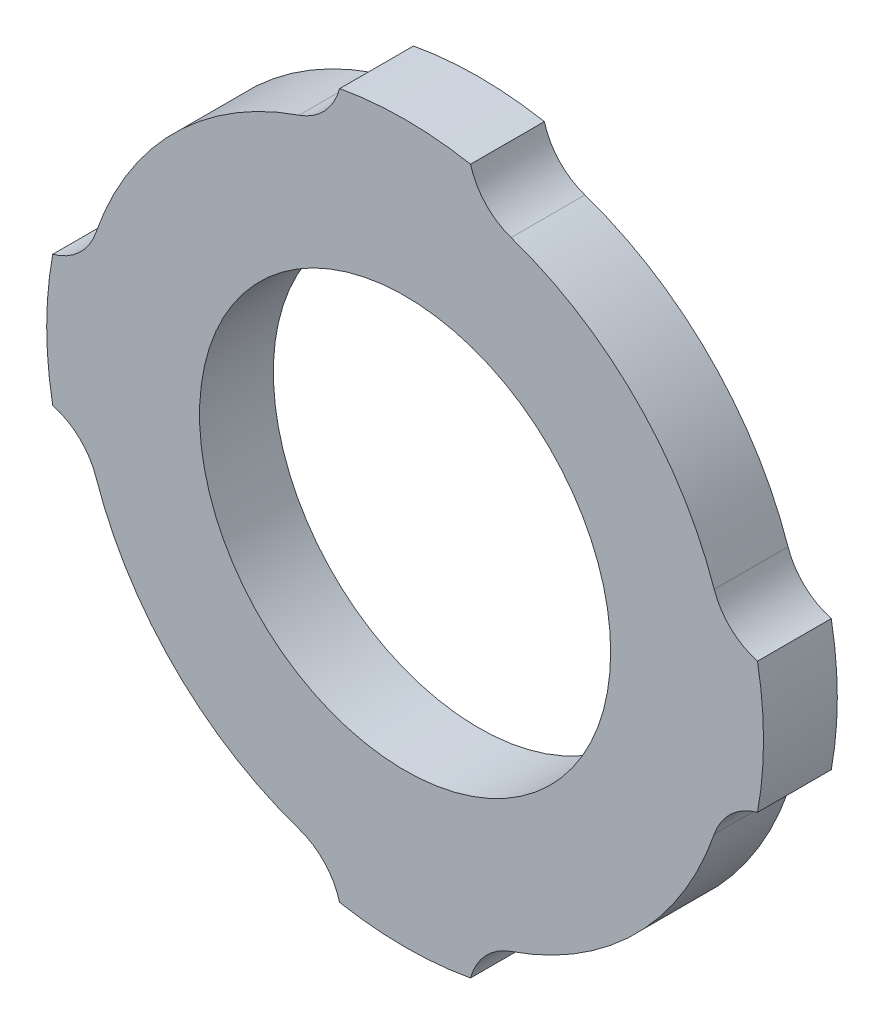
ISO-10303-21;
HEADER;
FILE_DESCRIPTION(('STEP AP214'),'2;1');
FILE_NAME('part.step','',(''),(''),'','','');
FILE_SCHEMA(('AUTOMOTIVE_DESIGN { 1 0 10303 214 1 1 1 1 }'));
ENDSEC;
DATA;
#1=APPLICATION_CONTEXT('core data for automotive mechanical design processes');
#2=APPLICATION_PROTOCOL_DEFINITION('international standard','automotive_design',2000,#1);
#3=PRODUCT_CONTEXT('',#1,'mechanical');
#4=PRODUCT('Part','Part','',(#3));
#5=PRODUCT_RELATED_PRODUCT_CATEGORY('part','',(#4));
#6=PRODUCT_DEFINITION_FORMATION('','',#4);
#7=PRODUCT_DEFINITION_CONTEXT('part definition',#1,'design');
#8=PRODUCT_DEFINITION('design','',#6,#7);
#9=PRODUCT_DEFINITION_SHAPE('','',#8);
#10=(LENGTH_UNIT() NAMED_UNIT(*) SI_UNIT(.MILLI.,.METRE.));
#11=(NAMED_UNIT(*) PLANE_ANGLE_UNIT() SI_UNIT($,.RADIAN.));
#12=(NAMED_UNIT(*) SI_UNIT($,.STERADIAN.) SOLID_ANGLE_UNIT());
#13=UNCERTAINTY_MEASURE_WITH_UNIT(LENGTH_MEASURE(1.E-05),#10,'distance_accuracy_value','');
#14=(GEOMETRIC_REPRESENTATION_CONTEXT(3) GLOBAL_UNCERTAINTY_ASSIGNED_CONTEXT((#13)) GLOBAL_UNIT_ASSIGNED_CONTEXT((#10,
#11,#12)) REPRESENTATION_CONTEXT('',''));
#15=CARTESIAN_POINT('',(0.,0.,0.));
#16=DIRECTION('',(0.,0.,1.));
#17=DIRECTION('',(1.,0.,0.));
#18=AXIS2_PLACEMENT_3D('',#15,#16,#17);
#19=CARTESIAN_POINT('',(0.,0.,6.99999999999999));
#20=DIRECTION('',(0.,0.,-1.));
#21=DIRECTION('',(-1.,0.,0.));
#22=AXIS2_PLACEMENT_3D('',#19,#20,#21);
#23=PLANE('',#22);
#24=CARTESIAN_POINT('',(0.,0.,6.99999999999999));
#25=DIRECTION('',(0.,0.,1.));
#26=DIRECTION('',(1.,0.,0.));
#27=AXIS2_PLACEMENT_3D('',#24,#25,#26);
#28=CIRCLE('',#27,19.5);
#29=CARTESIAN_POINT('',(19.5,0.,6.99999999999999));
#30=VERTEX_POINT('',#29);
#31=EDGE_CURVE('E143',#30,#30,#28,.F.);
#32=ORIENTED_EDGE('',*,*,#31,.T.);
#33=EDGE_LOOP('',(#32));
#34=FACE_BOUND('',#33,.T.);
#35=CARTESIAN_POINT('',(-35.,-12.,6.99999999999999));
#36=DIRECTION('',(0.,0.,-1.));
#37=DIRECTION('',(-1.,0.,0.));
#38=AXIS2_PLACEMENT_3D('',#35,#36,#37);
#39=CIRCLE('',#38,6.);
#40=CARTESIAN_POINT('',(-33.4281539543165,-6.20955096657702,6.99999999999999));
#41=VERTEX_POINT('',#40);
#42=CARTESIAN_POINT('',(-29.3243243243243,-10.054054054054,6.99999999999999));
#43=VERTEX_POINT('',#42);
#44=EDGE_CURVE('E131',#41,#43,#39,.T.);
#45=ORIENTED_EDGE('',*,*,#44,.T.);
#46=CARTESIAN_POINT('',(0.,0.,6.99999999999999));
#47=DIRECTION('',(0.,0.,1.));
#48=DIRECTION('',(1.,0.,0.));
#49=AXIS2_PLACEMENT_3D('',#46,#47,#48);
#50=CIRCLE('',#49,31.);
#51=CARTESIAN_POINT('',(-10.0540540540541,-29.3243243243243,6.99999999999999));
#52=VERTEX_POINT('',#51);
#53=EDGE_CURVE('E146',#52,#43,#50,.F.);
#54=ORIENTED_EDGE('',*,*,#53,.F.);
#55=CARTESIAN_POINT('',(-12.,-35.,6.99999999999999));
#56=DIRECTION('',(0.,0.,1.));
#57=DIRECTION('',(1.,0.,0.));
#58=AXIS2_PLACEMENT_3D('',#55,#56,#57);
#59=CIRCLE('',#58,6.);
#60=CARTESIAN_POINT('',(-6.20955096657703,-33.4281539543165,6.99999999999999));
#61=VERTEX_POINT('',#60);
#62=EDGE_CURVE('E154',#52,#61,#59,.F.);
#63=ORIENTED_EDGE('',*,*,#62,.T.);
#64=CARTESIAN_POINT('',(0.,0.,6.99999999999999));
#65=DIRECTION('',(0.,0.,-1.));
#66=DIRECTION('',(-1.,0.,0.));
#67=AXIS2_PLACEMENT_3D('',#64,#65,#66);
#68=CIRCLE('',#67,34.);
#69=CARTESIAN_POINT('',(6.20955096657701,-33.4281539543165,6.99999999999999));
#70=VERTEX_POINT('',#69);
#71=EDGE_CURVE('E157',#70,#61,#68,.T.);
#72=ORIENTED_EDGE('',*,*,#71,.F.);
#73=CARTESIAN_POINT('',(12.,-35.,6.99999999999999));
#74=DIRECTION('',(0.,0.,-1.));
#75=DIRECTION('',(-1.,0.,0.));
#76=AXIS2_PLACEMENT_3D('',#73,#74,#75);
#77=CIRCLE('',#76,6.);
#78=CARTESIAN_POINT('',(10.054054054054,-29.3243243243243,6.99999999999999));
#79=VERTEX_POINT('',#78);
#80=EDGE_CURVE('E161',#70,#79,#77,.T.);
#81=ORIENTED_EDGE('',*,*,#80,.T.);
#82=CARTESIAN_POINT('',(0.,0.,6.99999999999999));
#83=DIRECTION('',(0.,0.,1.));
#84=DIRECTION('',(1.,0.,0.));
#85=AXIS2_PLACEMENT_3D('',#82,#83,#84);
#86=CIRCLE('',#85,31.);
#87=CARTESIAN_POINT('',(29.3243243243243,-10.0540540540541,6.99999999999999));
#88=VERTEX_POINT('',#87);
#89=EDGE_CURVE('E164',#88,#79,#86,.F.);
#90=ORIENTED_EDGE('',*,*,#89,.F.);
#91=CARTESIAN_POINT('',(35.,-12.,6.99999999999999));
#92=DIRECTION('',(0.,0.,1.));
#93=DIRECTION('',(1.,0.,0.));
#94=AXIS2_PLACEMENT_3D('',#91,#92,#93);
#95=CIRCLE('',#94,6.);
#96=CARTESIAN_POINT('',(33.4281539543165,-6.20955096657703,6.99999999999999));
#97=VERTEX_POINT('',#96);
#98=EDGE_CURVE('E168',#88,#97,#95,.F.);
#99=ORIENTED_EDGE('',*,*,#98,.T.);
#100=CARTESIAN_POINT('',(0.,0.,6.99999999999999));
#101=DIRECTION('',(0.,0.,-1.));
#102=DIRECTION('',(-1.,0.,0.));
#103=AXIS2_PLACEMENT_3D('',#100,#101,#102);
#104=CIRCLE('',#103,34.);
#105=CARTESIAN_POINT('',(33.4281539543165,6.20955096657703,6.99999999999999));
#106=VERTEX_POINT('',#105);
#107=EDGE_CURVE('E171',#106,#97,#104,.T.);
#108=ORIENTED_EDGE('',*,*,#107,.F.);
#109=CARTESIAN_POINT('',(35.,12.,6.99999999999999));
#110=DIRECTION('',(0.,0.,-1.));
#111=DIRECTION('',(-1.,0.,0.));
#112=AXIS2_PLACEMENT_3D('',#109,#110,#111);
#113=CIRCLE('',#112,6.);
#114=CARTESIAN_POINT('',(29.3243243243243,10.054054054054,6.99999999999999));
#115=VERTEX_POINT('',#114);
#116=EDGE_CURVE('E175',#106,#115,#113,.T.);
#117=ORIENTED_EDGE('',*,*,#116,.T.);
#118=CARTESIAN_POINT('',(0.,0.,6.99999999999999));
#119=DIRECTION('',(0.,0.,1.));
#120=DIRECTION('',(1.,0.,0.));
#121=AXIS2_PLACEMENT_3D('',#118,#119,#120);
#122=CIRCLE('',#121,31.);
#123=CARTESIAN_POINT('',(10.0540540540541,29.3243243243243,6.99999999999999));
#124=VERTEX_POINT('',#123);
#125=EDGE_CURVE('E178',#124,#115,#122,.F.);
#126=ORIENTED_EDGE('',*,*,#125,.F.);
#127=CARTESIAN_POINT('',(12.,35.,6.99999999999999));
#128=DIRECTION('',(0.,0.,1.));
#129=DIRECTION('',(1.,0.,0.));
#130=AXIS2_PLACEMENT_3D('',#127,#128,#129);
#131=CIRCLE('',#130,6.);
#132=CARTESIAN_POINT('',(6.20955096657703,33.4281539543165,6.99999999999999));
#133=VERTEX_POINT('',#132);
#134=EDGE_CURVE('E182',#124,#133,#131,.F.);
#135=ORIENTED_EDGE('',*,*,#134,.T.);
#136=CARTESIAN_POINT('',(0.,0.,6.99999999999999));
#137=DIRECTION('',(0.,0.,-1.));
#138=DIRECTION('',(-1.,0.,0.));
#139=AXIS2_PLACEMENT_3D('',#136,#137,#138);
#140=CIRCLE('',#139,34.);
#141=CARTESIAN_POINT('',(-6.20955096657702,33.4281539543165,6.99999999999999));
#142=VERTEX_POINT('',#141);
#143=EDGE_CURVE('E185',#142,#133,#140,.T.);
#144=ORIENTED_EDGE('',*,*,#143,.F.);
#145=CARTESIAN_POINT('',(-12.,35.,6.99999999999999));
#146=DIRECTION('',(0.,0.,-1.));
#147=DIRECTION('',(-1.,0.,0.));
#148=AXIS2_PLACEMENT_3D('',#145,#146,#147);
#149=CIRCLE('',#148,6.);
#150=CARTESIAN_POINT('',(-10.054054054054,29.3243243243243,6.99999999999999));
#151=VERTEX_POINT('',#150);
#152=EDGE_CURVE('E189',#142,#151,#149,.T.);
#153=ORIENTED_EDGE('',*,*,#152,.T.);
#154=CARTESIAN_POINT('',(0.,0.,6.99999999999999));
#155=DIRECTION('',(0.,0.,1.));
#156=DIRECTION('',(1.,0.,0.));
#157=AXIS2_PLACEMENT_3D('',#154,#155,#156);
#158=CIRCLE('',#157,31.);
#159=CARTESIAN_POINT('',(-29.3243243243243,10.0540540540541,6.99999999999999));
#160=VERTEX_POINT('',#159);
#161=EDGE_CURVE('E192',#160,#151,#158,.F.);
#162=ORIENTED_EDGE('',*,*,#161,.F.);
#163=CARTESIAN_POINT('',(-35.,12.,6.99999999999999));
#164=DIRECTION('',(0.,0.,1.));
#165=DIRECTION('',(1.,0.,0.));
#166=AXIS2_PLACEMENT_3D('',#163,#164,#165);
#167=CIRCLE('',#166,6.);
#168=CARTESIAN_POINT('',(-33.4281539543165,6.20955096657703,6.99999999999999));
#169=VERTEX_POINT('',#168);
#170=EDGE_CURVE('E133',#160,#169,#167,.F.);
#171=ORIENTED_EDGE('',*,*,#170,.T.);
#172=CARTESIAN_POINT('',(0.,0.,6.99999999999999));
#173=DIRECTION('',(0.,0.,-1.));
#174=DIRECTION('',(-1.,0.,0.));
#175=AXIS2_PLACEMENT_3D('',#172,#173,#174);
#176=CIRCLE('',#175,34.);
#177=EDGE_CURVE('E20',#41,#169,#176,.T.);
#178=ORIENTED_EDGE('',*,*,#177,.F.);
#179=EDGE_LOOP('',(#45,#54,#63,#72,#81,#90,#99,#108,#117,#126,#135,#144,#153,#162,#171,#178));
#180=FACE_BOUND('',#179,.T.);
#181=ADVANCED_FACE('F17',(#34,#180),#23,.F.);
#182=CARTESIAN_POINT('',(0.,0.,6.99999999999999));
#183=DIRECTION('',(0.,0.,-1.));
#184=DIRECTION('',(-1.,0.,0.));
#185=AXIS2_PLACEMENT_3D('',#182,#183,#184);
#186=CYLINDRICAL_SURFACE('',#185,34.);
#187=ORIENTED_EDGE('',*,*,#177,.T.);
#188=DIRECTION('',(0.,0.,1.));
#189=VECTOR('',#188,1.);
#190=CARTESIAN_POINT('',(-33.4281539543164,6.20955096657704,0.));
#191=LINE('',#190,#189);
#192=CARTESIAN_POINT('',(-33.4281539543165,6.20955096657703,0.));
#193=VERTEX_POINT('',#192);
#194=EDGE_CURVE('E195',#169,#193,#191,.F.);
#195=ORIENTED_EDGE('',*,*,#194,.T.);
#196=CARTESIAN_POINT('',(0.,0.,0.));
#197=DIRECTION('',(0.,0.,-1.));
#198=DIRECTION('',(-1.,0.,0.));
#199=AXIS2_PLACEMENT_3D('',#196,#197,#198);
#200=CIRCLE('',#199,34.);
#201=CARTESIAN_POINT('',(-33.4281539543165,-6.20955096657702,0.));
#202=VERTEX_POINT('',#201);
#203=EDGE_CURVE('E140',#202,#193,#200,.T.);
#204=ORIENTED_EDGE('',*,*,#203,.F.);
#205=DIRECTION('',(0.,0.,-1.));
#206=VECTOR('',#205,1.);
#207=CARTESIAN_POINT('',(-33.4281539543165,-6.20955096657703,0.));
#208=LINE('',#207,#206);
#209=EDGE_CURVE('E137',#202,#41,#208,.F.);
#210=ORIENTED_EDGE('',*,*,#209,.T.);
#211=EDGE_LOOP('',(#187,#195,#204,#210));
#212=FACE_BOUND('',#211,.T.);
#213=ADVANCED_FACE('F138',(#212),#186,.T.);
#214=CARTESIAN_POINT('',(-35.,12.,0.));
#215=DIRECTION('',(0.,0.,1.));
#216=DIRECTION('',(1.,0.,0.));
#217=AXIS2_PLACEMENT_3D('',#214,#215,#216);
#218=CYLINDRICAL_SURFACE('',#217,6.);
#219=ORIENTED_EDGE('',*,*,#170,.F.);
#220=DIRECTION('',(0.,0.,1.));
#221=VECTOR('',#220,1.);
#222=CARTESIAN_POINT('',(-29.3243243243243,10.0540540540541,0.));
#223=LINE('',#222,#221);
#224=CARTESIAN_POINT('',(-29.3243243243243,10.0540540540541,0.));
#225=VERTEX_POINT('',#224);
#226=EDGE_CURVE('E194',#225,#160,#223,.T.);
#227=ORIENTED_EDGE('',*,*,#226,.F.);
#228=CARTESIAN_POINT('',(-35.,12.,0.));
#229=DIRECTION('',(0.,0.,1.));
#230=DIRECTION('',(1.,0.,0.));
#231=AXIS2_PLACEMENT_3D('',#228,#229,#230);
#232=CIRCLE('',#231,6.);
#233=EDGE_CURVE('E242',#193,#225,#232,.T.);
#234=ORIENTED_EDGE('',*,*,#233,.F.);
#235=ORIENTED_EDGE('',*,*,#194,.F.);
#236=EDGE_LOOP('',(#219,#227,#234,#235));
#237=FACE_BOUND('',#236,.T.);
#238=ADVANCED_FACE('F314',(#237),#218,.F.);
#239=CARTESIAN_POINT('',(0.,0.,0.));
#240=DIRECTION('',(0.,0.,1.));
#241=DIRECTION('',(1.,0.,0.));
#242=AXIS2_PLACEMENT_3D('',#239,#240,#241);
#243=CYLINDRICAL_SURFACE('',#242,31.);
#244=DIRECTION('',(0.,0.,-1.));
#245=VECTOR('',#244,1.);
#246=CARTESIAN_POINT('',(-10.054054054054,29.3243243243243,0.));
#247=LINE('',#246,#245);
#248=CARTESIAN_POINT('',(-10.054054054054,29.3243243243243,0.));
#249=VERTEX_POINT('',#248);
#250=EDGE_CURVE('E191',#151,#249,#247,.T.);
#251=ORIENTED_EDGE('',*,*,#250,.T.);
#252=CARTESIAN_POINT('',(0.,0.,0.));
#253=DIRECTION('',(0.,0.,1.));
#254=DIRECTION('',(1.,0.,0.));
#255=AXIS2_PLACEMENT_3D('',#252,#253,#254);
#256=CIRCLE('',#255,31.);
#257=EDGE_CURVE('E239',#225,#249,#256,.F.);
#258=ORIENTED_EDGE('',*,*,#257,.F.);
#259=ORIENTED_EDGE('',*,*,#226,.T.);
#260=ORIENTED_EDGE('',*,*,#161,.T.);
#261=EDGE_LOOP('',(#251,#258,#259,#260));
#262=FACE_BOUND('',#261,.T.);
#263=ADVANCED_FACE('F310',(#262),#243,.T.);
#264=CARTESIAN_POINT('',(-12.,35.,0.));
#265=DIRECTION('',(0.,0.,-1.));
#266=DIRECTION('',(-1.,0.,0.));
#267=AXIS2_PLACEMENT_3D('',#264,#265,#266);
#268=CYLINDRICAL_SURFACE('',#267,6.);
#269=CARTESIAN_POINT('',(-12.,35.,0.));
#270=DIRECTION('',(0.,0.,-1.));
#271=DIRECTION('',(-1.,0.,0.));
#272=AXIS2_PLACEMENT_3D('',#269,#270,#271);
#273=CIRCLE('',#272,6.);
#274=CARTESIAN_POINT('',(-6.20955096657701,33.4281539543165,0.));
#275=VERTEX_POINT('',#274);
#276=EDGE_CURVE('E236',#249,#275,#273,.F.);
#277=ORIENTED_EDGE('',*,*,#276,.F.);
#278=ORIENTED_EDGE('',*,*,#250,.F.);
#279=ORIENTED_EDGE('',*,*,#152,.F.);
#280=DIRECTION('',(0.,0.,-1.));
#281=VECTOR('',#280,1.);
#282=CARTESIAN_POINT('',(-6.20955096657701,33.4281539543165,6.99999999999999));
#283=LINE('',#282,#281);
#284=EDGE_CURVE('E188',#275,#142,#283,.F.);
#285=ORIENTED_EDGE('',*,*,#284,.F.);
#286=EDGE_LOOP('',(#277,#278,#279,#285));
#287=FACE_BOUND('',#286,.T.);
#288=ADVANCED_FACE('F306',(#287),#268,.F.);
#289=CARTESIAN_POINT('',(0.,0.,6.99999999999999));
#290=DIRECTION('',(0.,0.,-1.));
#291=DIRECTION('',(-1.,0.,0.));
#292=AXIS2_PLACEMENT_3D('',#289,#290,#291);
#293=CYLINDRICAL_SURFACE('',#292,34.);
#294=ORIENTED_EDGE('',*,*,#143,.T.);
#295=DIRECTION('',(0.,0.,1.));
#296=VECTOR('',#295,1.);
#297=CARTESIAN_POINT('',(6.20955096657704,33.4281539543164,0.));
#298=LINE('',#297,#296);
#299=CARTESIAN_POINT('',(6.20955096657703,33.4281539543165,0.));
#300=VERTEX_POINT('',#299);
#301=EDGE_CURVE('E184',#133,#300,#298,.F.);
#302=ORIENTED_EDGE('',*,*,#301,.T.);
#303=CARTESIAN_POINT('',(0.,0.,0.));
#304=DIRECTION('',(0.,0.,-1.));
#305=DIRECTION('',(-1.,0.,0.));
#306=AXIS2_PLACEMENT_3D('',#303,#304,#305);
#307=CIRCLE('',#306,34.);
#308=EDGE_CURVE('E233',#275,#300,#307,.T.);
#309=ORIENTED_EDGE('',*,*,#308,.F.);
#310=ORIENTED_EDGE('',*,*,#284,.T.);
#311=EDGE_LOOP('',(#294,#302,#309,#310));
#312=FACE_BOUND('',#311,.T.);
#313=ADVANCED_FACE('F302',(#312),#293,.T.);
#314=CARTESIAN_POINT('',(12.,35.,0.));
#315=DIRECTION('',(0.,0.,1.));
#316=DIRECTION('',(1.,0.,0.));
#317=AXIS2_PLACEMENT_3D('',#314,#315,#316);
#318=CYLINDRICAL_SURFACE('',#317,6.);
#319=ORIENTED_EDGE('',*,*,#134,.F.);
#320=DIRECTION('',(0.,0.,1.));
#321=VECTOR('',#320,1.);
#322=CARTESIAN_POINT('',(10.0540540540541,29.3243243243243,0.));
#323=LINE('',#322,#321);
#324=CARTESIAN_POINT('',(10.0540540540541,29.3243243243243,0.));
#325=VERTEX_POINT('',#324);
#326=EDGE_CURVE('E181',#325,#124,#323,.T.);
#327=ORIENTED_EDGE('',*,*,#326,.F.);
#328=CARTESIAN_POINT('',(12.,35.,0.));
#329=DIRECTION('',(0.,0.,1.));
#330=DIRECTION('',(1.,0.,0.));
#331=AXIS2_PLACEMENT_3D('',#328,#329,#330);
#332=CIRCLE('',#331,6.);
#333=EDGE_CURVE('E230',#300,#325,#332,.T.);
#334=ORIENTED_EDGE('',*,*,#333,.F.);
#335=ORIENTED_EDGE('',*,*,#301,.F.);
#336=EDGE_LOOP('',(#319,#327,#334,#335));
#337=FACE_BOUND('',#336,.T.);
#338=ADVANCED_FACE('F298',(#337),#318,.F.);
#339=CARTESIAN_POINT('',(0.,0.,0.));
#340=DIRECTION('',(0.,0.,1.));
#341=DIRECTION('',(1.,0.,0.));
#342=AXIS2_PLACEMENT_3D('',#339,#340,#341);
#343=CYLINDRICAL_SURFACE('',#342,31.);
#344=ORIENTED_EDGE('',*,*,#326,.T.);
#345=ORIENTED_EDGE('',*,*,#125,.T.);
#346=DIRECTION('',(0.,0.,-1.));
#347=VECTOR('',#346,1.);
#348=CARTESIAN_POINT('',(29.3243243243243,10.054054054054,0.));
#349=LINE('',#348,#347);
#350=CARTESIAN_POINT('',(29.3243243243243,10.054054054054,0.));
#351=VERTEX_POINT('',#350);
#352=EDGE_CURVE('E177',#115,#351,#349,.T.);
#353=ORIENTED_EDGE('',*,*,#352,.T.);
#354=CARTESIAN_POINT('',(0.,0.,0.));
#355=DIRECTION('',(0.,0.,1.));
#356=DIRECTION('',(1.,0.,0.));
#357=AXIS2_PLACEMENT_3D('',#354,#355,#356);
#358=CIRCLE('',#357,31.);
#359=EDGE_CURVE('E227',#325,#351,#358,.F.);
#360=ORIENTED_EDGE('',*,*,#359,.F.);
#361=EDGE_LOOP('',(#344,#345,#353,#360));
#362=FACE_BOUND('',#361,.T.);
#363=ADVANCED_FACE('F294',(#362),#343,.T.);
#364=CARTESIAN_POINT('',(35.,12.,0.));
#365=DIRECTION('',(0.,0.,-1.));
#366=DIRECTION('',(-1.,0.,0.));
#367=AXIS2_PLACEMENT_3D('',#364,#365,#366);
#368=CYLINDRICAL_SURFACE('',#367,6.);
#369=CARTESIAN_POINT('',(35.,12.,0.));
#370=DIRECTION('',(0.,0.,-1.));
#371=DIRECTION('',(-1.,0.,0.));
#372=AXIS2_PLACEMENT_3D('',#369,#370,#371);
#373=CIRCLE('',#372,6.);
#374=CARTESIAN_POINT('',(33.4281539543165,6.20955096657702,0.));
#375=VERTEX_POINT('',#374);
#376=EDGE_CURVE('E224',#351,#375,#373,.F.);
#377=ORIENTED_EDGE('',*,*,#376,.F.);
#378=ORIENTED_EDGE('',*,*,#352,.F.);
#379=ORIENTED_EDGE('',*,*,#116,.F.);
#380=DIRECTION('',(0.,0.,-1.));
#381=VECTOR('',#380,1.);
#382=CARTESIAN_POINT('',(33.4281539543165,6.20955096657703,6.99999999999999));
#383=LINE('',#382,#381);
#384=EDGE_CURVE('E174',#375,#106,#383,.F.);
#385=ORIENTED_EDGE('',*,*,#384,.F.);
#386=EDGE_LOOP('',(#377,#378,#379,#385));
#387=FACE_BOUND('',#386,.T.);
#388=ADVANCED_FACE('F290',(#387),#368,.F.);
#389=CARTESIAN_POINT('',(0.,0.,6.99999999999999));
#390=DIRECTION('',(0.,0.,-1.));
#391=DIRECTION('',(-1.,0.,0.));
#392=AXIS2_PLACEMENT_3D('',#389,#390,#391);
#393=CYLINDRICAL_SURFACE('',#392,34.);
#394=ORIENTED_EDGE('',*,*,#107,.T.);
#395=DIRECTION('',(0.,0.,1.));
#396=VECTOR('',#395,1.);
#397=CARTESIAN_POINT('',(33.4281539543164,-6.20955096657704,0.));
#398=LINE('',#397,#396);
#399=CARTESIAN_POINT('',(33.4281539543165,-6.20955096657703,0.));
#400=VERTEX_POINT('',#399);
#401=EDGE_CURVE('E170',#97,#400,#398,.F.);
#402=ORIENTED_EDGE('',*,*,#401,.T.);
#403=CARTESIAN_POINT('',(0.,0.,0.));
#404=DIRECTION('',(0.,0.,-1.));
#405=DIRECTION('',(-1.,0.,0.));
#406=AXIS2_PLACEMENT_3D('',#403,#404,#405);
#407=CIRCLE('',#406,34.);
#408=EDGE_CURVE('E221',#375,#400,#407,.T.);
#409=ORIENTED_EDGE('',*,*,#408,.F.);
#410=ORIENTED_EDGE('',*,*,#384,.T.);
#411=EDGE_LOOP('',(#394,#402,#409,#410));
#412=FACE_BOUND('',#411,.T.);
#413=ADVANCED_FACE('F286',(#412),#393,.T.);
#414=CARTESIAN_POINT('',(35.,-12.,0.));
#415=DIRECTION('',(0.,0.,1.));
#416=DIRECTION('',(1.,0.,0.));
#417=AXIS2_PLACEMENT_3D('',#414,#415,#416);
#418=CYLINDRICAL_SURFACE('',#417,6.);
#419=ORIENTED_EDGE('',*,*,#98,.F.);
#420=DIRECTION('',(0.,0.,1.));
#421=VECTOR('',#420,1.);
#422=CARTESIAN_POINT('',(29.3243243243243,-10.0540540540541,0.));
#423=LINE('',#422,#421);
#424=CARTESIAN_POINT('',(29.3243243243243,-10.0540540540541,0.));
#425=VERTEX_POINT('',#424);
#426=EDGE_CURVE('E167',#425,#88,#423,.T.);
#427=ORIENTED_EDGE('',*,*,#426,.F.);
#428=CARTESIAN_POINT('',(35.,-12.,0.));
#429=DIRECTION('',(0.,0.,1.));
#430=DIRECTION('',(1.,0.,0.));
#431=AXIS2_PLACEMENT_3D('',#428,#429,#430);
#432=CIRCLE('',#431,6.);
#433=EDGE_CURVE('E218',#400,#425,#432,.T.);
#434=ORIENTED_EDGE('',*,*,#433,.F.);
#435=ORIENTED_EDGE('',*,*,#401,.F.);
#436=EDGE_LOOP('',(#419,#427,#434,#435));
#437=FACE_BOUND('',#436,.T.);
#438=ADVANCED_FACE('F282',(#437),#418,.F.);
#439=CARTESIAN_POINT('',(0.,0.,0.));
#440=DIRECTION('',(0.,0.,1.));
#441=DIRECTION('',(1.,0.,0.));
#442=AXIS2_PLACEMENT_3D('',#439,#440,#441);
#443=CYLINDRICAL_SURFACE('',#442,31.);
#444=DIRECTION('',(0.,0.,-1.));
#445=VECTOR('',#444,1.);
#446=CARTESIAN_POINT('',(10.054054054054,-29.3243243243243,0.));
#447=LINE('',#446,#445);
#448=CARTESIAN_POINT('',(10.054054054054,-29.3243243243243,0.));
#449=VERTEX_POINT('',#448);
#450=EDGE_CURVE('E163',#79,#449,#447,.T.);
#451=ORIENTED_EDGE('',*,*,#450,.T.);
#452=CARTESIAN_POINT('',(0.,0.,0.));
#453=DIRECTION('',(0.,0.,1.));
#454=DIRECTION('',(1.,0.,0.));
#455=AXIS2_PLACEMENT_3D('',#452,#453,#454);
#456=CIRCLE('',#455,31.);
#457=EDGE_CURVE('E215',#425,#449,#456,.F.);
#458=ORIENTED_EDGE('',*,*,#457,.F.);
#459=ORIENTED_EDGE('',*,*,#426,.T.);
#460=ORIENTED_EDGE('',*,*,#89,.T.);
#461=EDGE_LOOP('',(#451,#458,#459,#460));
#462=FACE_BOUND('',#461,.T.);
#463=ADVANCED_FACE('F278',(#462),#443,.T.);
#464=CARTESIAN_POINT('',(12.,-35.,0.));
#465=DIRECTION('',(0.,0.,-1.));
#466=DIRECTION('',(-1.,0.,0.));
#467=AXIS2_PLACEMENT_3D('',#464,#465,#466);
#468=CYLINDRICAL_SURFACE('',#467,6.);
#469=CARTESIAN_POINT('',(12.,-35.,0.));
#470=DIRECTION('',(0.,0.,-1.));
#471=DIRECTION('',(-1.,0.,0.));
#472=AXIS2_PLACEMENT_3D('',#469,#470,#471);
#473=CIRCLE('',#472,6.);
#474=CARTESIAN_POINT('',(6.209550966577,-33.4281539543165,0.));
#475=VERTEX_POINT('',#474);
#476=EDGE_CURVE('E212',#449,#475,#473,.F.);
#477=ORIENTED_EDGE('',*,*,#476,.F.);
#478=ORIENTED_EDGE('',*,*,#450,.F.);
#479=ORIENTED_EDGE('',*,*,#80,.F.);
#480=DIRECTION('',(0.,0.,-1.));
#481=VECTOR('',#480,1.);
#482=CARTESIAN_POINT('',(6.209550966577,-33.4281539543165,6.99999999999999));
#483=LINE('',#482,#481);
#484=EDGE_CURVE('E160',#475,#70,#483,.F.);
#485=ORIENTED_EDGE('',*,*,#484,.F.);
#486=EDGE_LOOP('',(#477,#478,#479,#485));
#487=FACE_BOUND('',#486,.T.);
#488=ADVANCED_FACE('F274',(#487),#468,.F.);
#489=CARTESIAN_POINT('',(0.,0.,6.99999999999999));
#490=DIRECTION('',(0.,0.,-1.));
#491=DIRECTION('',(-1.,0.,0.));
#492=AXIS2_PLACEMENT_3D('',#489,#490,#491);
#493=CYLINDRICAL_SURFACE('',#492,34.);
#494=ORIENTED_EDGE('',*,*,#71,.T.);
#495=DIRECTION('',(0.,0.,1.));
#496=VECTOR('',#495,1.);
#497=CARTESIAN_POINT('',(-6.20955096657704,-33.4281539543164,0.));
#498=LINE('',#497,#496);
#499=CARTESIAN_POINT('',(-6.20955096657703,-33.4281539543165,0.));
#500=VERTEX_POINT('',#499);
#501=EDGE_CURVE('E156',#61,#500,#498,.F.);
#502=ORIENTED_EDGE('',*,*,#501,.T.);
#503=CARTESIAN_POINT('',(0.,0.,0.));
#504=DIRECTION('',(0.,0.,-1.));
#505=DIRECTION('',(-1.,0.,0.));
#506=AXIS2_PLACEMENT_3D('',#503,#504,#505);
#507=CIRCLE('',#506,34.);
#508=EDGE_CURVE('E209',#475,#500,#507,.T.);
#509=ORIENTED_EDGE('',*,*,#508,.F.);
#510=ORIENTED_EDGE('',*,*,#484,.T.);
#511=EDGE_LOOP('',(#494,#502,#509,#510));
#512=FACE_BOUND('',#511,.T.);
#513=ADVANCED_FACE('F270',(#512),#493,.T.);
#514=CARTESIAN_POINT('',(-12.,-35.,0.));
#515=DIRECTION('',(0.,0.,1.));
#516=DIRECTION('',(1.,0.,0.));
#517=AXIS2_PLACEMENT_3D('',#514,#515,#516);
#518=CYLINDRICAL_SURFACE('',#517,6.);
#519=ORIENTED_EDGE('',*,*,#62,.F.);
#520=DIRECTION('',(0.,0.,1.));
#521=VECTOR('',#520,1.);
#522=CARTESIAN_POINT('',(-10.0540540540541,-29.3243243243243,0.));
#523=LINE('',#522,#521);
#524=CARTESIAN_POINT('',(-10.0540540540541,-29.3243243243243,0.));
#525=VERTEX_POINT('',#524);
#526=EDGE_CURVE('E149',#525,#52,#523,.T.);
#527=ORIENTED_EDGE('',*,*,#526,.F.);
#528=CARTESIAN_POINT('',(-12.,-35.,0.));
#529=DIRECTION('',(0.,0.,1.));
#530=DIRECTION('',(1.,0.,0.));
#531=AXIS2_PLACEMENT_3D('',#528,#529,#530);
#532=CIRCLE('',#531,6.);
#533=EDGE_CURVE('E206',#500,#525,#532,.T.);
#534=ORIENTED_EDGE('',*,*,#533,.F.);
#535=ORIENTED_EDGE('',*,*,#501,.F.);
#536=EDGE_LOOP('',(#519,#527,#534,#535));
#537=FACE_BOUND('',#536,.T.);
#538=ADVANCED_FACE('F267',(#537),#518,.F.);
#539=CARTESIAN_POINT('',(0.,0.,0.));
#540=DIRECTION('',(0.,0.,1.));
#541=DIRECTION('',(1.,0.,0.));
#542=AXIS2_PLACEMENT_3D('',#539,#540,#541);
#543=CYLINDRICAL_SURFACE('',#542,31.);
#544=DIRECTION('',(0.,0.,-1.));
#545=VECTOR('',#544,1.);
#546=CARTESIAN_POINT('',(-29.3243243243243,-10.054054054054,0.));
#547=LINE('',#546,#545);
#548=CARTESIAN_POINT('',(-29.3243243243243,-10.054054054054,0.));
#549=VERTEX_POINT('',#548);
#550=EDGE_CURVE('E35',#43,#549,#547,.T.);
#551=ORIENTED_EDGE('',*,*,#550,.T.);
#552=CARTESIAN_POINT('',(0.,0.,0.));
#553=DIRECTION('',(0.,0.,1.));
#554=DIRECTION('',(1.,0.,0.));
#555=AXIS2_PLACEMENT_3D('',#552,#553,#554);
#556=CIRCLE('',#555,31.);
#557=EDGE_CURVE('E203',#525,#549,#556,.F.);
#558=ORIENTED_EDGE('',*,*,#557,.F.);
#559=ORIENTED_EDGE('',*,*,#526,.T.);
#560=ORIENTED_EDGE('',*,*,#53,.T.);
#561=EDGE_LOOP('',(#551,#558,#559,#560));
#562=FACE_BOUND('',#561,.T.);
#563=ADVANCED_FACE('F261',(#562),#543,.T.);
#564=CARTESIAN_POINT('',(-35.,-12.,0.));
#565=DIRECTION('',(0.,0.,-1.));
#566=DIRECTION('',(-1.,0.,0.));
#567=AXIS2_PLACEMENT_3D('',#564,#565,#566);
#568=CYLINDRICAL_SURFACE('',#567,6.);
#569=CARTESIAN_POINT('',(-35.,-12.,0.));
#570=DIRECTION('',(0.,0.,-1.));
#571=DIRECTION('',(-1.,0.,0.));
#572=AXIS2_PLACEMENT_3D('',#569,#570,#571);
#573=CIRCLE('',#572,6.);
#574=EDGE_CURVE('E26',#549,#202,#573,.F.);
#575=ORIENTED_EDGE('',*,*,#574,.F.);
#576=ORIENTED_EDGE('',*,*,#550,.F.);
#577=ORIENTED_EDGE('',*,*,#44,.F.);
#578=ORIENTED_EDGE('',*,*,#209,.F.);
#579=EDGE_LOOP('',(#575,#576,#577,#578));
#580=FACE_BOUND('',#579,.T.);
#581=ADVANCED_FACE('F145',(#580),#568,.F.);
#582=CARTESIAN_POINT('',(0.,0.,0.));
#583=DIRECTION('',(0.,0.,1.));
#584=DIRECTION('',(1.,0.,0.));
#585=AXIS2_PLACEMENT_3D('',#582,#583,#584);
#586=CYLINDRICAL_SURFACE('',#585,19.5);
#587=CARTESIAN_POINT('',(0.,0.,0.));
#588=DIRECTION('',(0.,0.,1.));
#589=DIRECTION('',(1.,0.,0.));
#590=AXIS2_PLACEMENT_3D('',#587,#588,#589);
#591=CIRCLE('',#590,19.5);
#592=CARTESIAN_POINT('',(19.5,0.,0.));
#593=VERTEX_POINT('',#592);
#594=EDGE_CURVE('E11',#593,#593,#591,.T.);
#595=ORIENTED_EDGE('',*,*,#594,.F.);
#596=EDGE_LOOP('',(#595));
#597=FACE_BOUND('',#596,.T.);
#598=ORIENTED_EDGE('',*,*,#31,.F.);
#599=EDGE_LOOP('',(#598));
#600=FACE_BOUND('',#599,.T.);
#601=ADVANCED_FACE('F249',(#597,#600),#586,.F.);
#602=CARTESIAN_POINT('',(0.,0.,0.));
#603=DIRECTION('',(0.,0.,-1.));
#604=DIRECTION('',(-1.,0.,0.));
#605=AXIS2_PLACEMENT_3D('',#602,#603,#604);
#606=PLANE('',#605);
#607=ORIENTED_EDGE('',*,*,#594,.T.);
#608=EDGE_LOOP('',(#607));
#609=FACE_BOUND('',#608,.T.);
#610=ORIENTED_EDGE('',*,*,#557,.T.);
#611=ORIENTED_EDGE('',*,*,#574,.T.);
#612=ORIENTED_EDGE('',*,*,#203,.T.);
#613=ORIENTED_EDGE('',*,*,#233,.T.);
#614=ORIENTED_EDGE('',*,*,#257,.T.);
#615=ORIENTED_EDGE('',*,*,#276,.T.);
#616=ORIENTED_EDGE('',*,*,#308,.T.);
#617=ORIENTED_EDGE('',*,*,#333,.T.);
#618=ORIENTED_EDGE('',*,*,#359,.T.);
#619=ORIENTED_EDGE('',*,*,#376,.T.);
#620=ORIENTED_EDGE('',*,*,#408,.T.);
#621=ORIENTED_EDGE('',*,*,#433,.T.);
#622=ORIENTED_EDGE('',*,*,#457,.T.);
#623=ORIENTED_EDGE('',*,*,#476,.T.);
#624=ORIENTED_EDGE('',*,*,#508,.T.);
#625=ORIENTED_EDGE('',*,*,#533,.T.);
#626=EDGE_LOOP('',(#610,#611,#612,#613,#614,#615,#616,#617,#618,#619,#620,#621,#622,#623,#624,#625));
#627=FACE_BOUND('',#626,.T.);
#628=ADVANCED_FACE('F251',(#609,#627),#606,.T.);
#629=CLOSED_SHELL('',(#181,#213,#238,#263,#288,#313,#338,#363,#388,#413,#438,#463,#488,#513,
#538,#563,#581,#601,#628));
#630=MANIFOLD_SOLID_BREP('B1',#629);
#631=ADVANCED_BREP_SHAPE_REPRESENTATION('',(#18,#630),#14);
#632=SHAPE_DEFINITION_REPRESENTATION(#9,#631);
ENDSEC;
END-ISO-10303-21;
